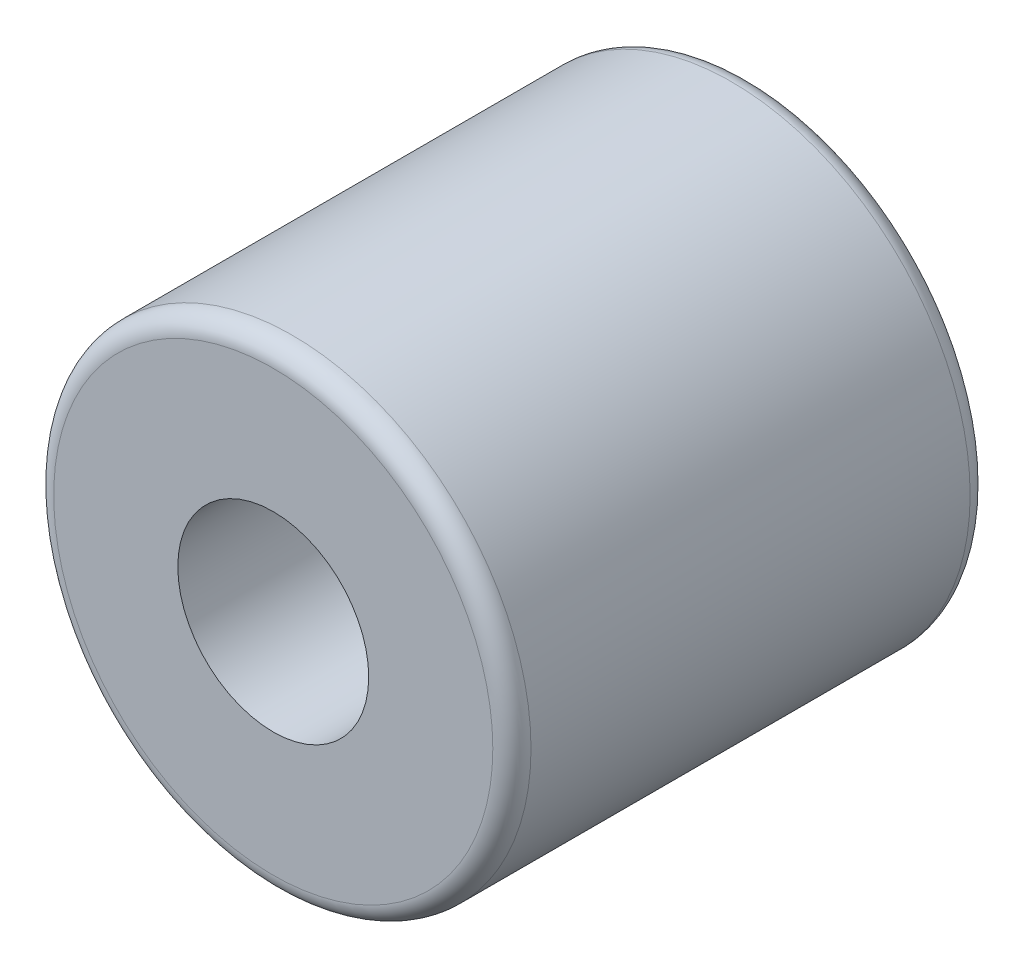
ISO-10303-21;
HEADER;
FILE_DESCRIPTION(('STEP AP214'),'2;1');
FILE_NAME('part.step','',(''),(''),'','','');
FILE_SCHEMA(('AUTOMOTIVE_DESIGN { 1 0 10303 214 1 1 1 1 }'));
ENDSEC;
DATA;
#1=APPLICATION_CONTEXT('core data for automotive mechanical design processes');
#2=APPLICATION_PROTOCOL_DEFINITION('international standard','automotive_design',2000,#1);
#3=PRODUCT_CONTEXT('',#1,'mechanical');
#4=PRODUCT('Part','Part','',(#3));
#5=PRODUCT_RELATED_PRODUCT_CATEGORY('part','',(#4));
#6=PRODUCT_DEFINITION_FORMATION('','',#4);
#7=PRODUCT_DEFINITION_CONTEXT('part definition',#1,'design');
#8=PRODUCT_DEFINITION('design','',#6,#7);
#9=PRODUCT_DEFINITION_SHAPE('','',#8);
#10=(LENGTH_UNIT() NAMED_UNIT(*) SI_UNIT(.MILLI.,.METRE.));
#11=(NAMED_UNIT(*) PLANE_ANGLE_UNIT() SI_UNIT($,.RADIAN.));
#12=(NAMED_UNIT(*) SI_UNIT($,.STERADIAN.) SOLID_ANGLE_UNIT());
#13=UNCERTAINTY_MEASURE_WITH_UNIT(LENGTH_MEASURE(1.E-05),#10,'distance_accuracy_value','');
#14=(GEOMETRIC_REPRESENTATION_CONTEXT(3) GLOBAL_UNCERTAINTY_ASSIGNED_CONTEXT((#13)) GLOBAL_UNIT_ASSIGNED_CONTEXT((#10,
#11,#12)) REPRESENTATION_CONTEXT('',''));
#15=CARTESIAN_POINT('',(0.,0.,0.));
#16=DIRECTION('',(0.,0.,1.));
#17=DIRECTION('',(1.,0.,0.));
#18=AXIS2_PLACEMENT_3D('',#15,#16,#17);
#19=CARTESIAN_POINT('',(0.,0.,63.5));
#20=DIRECTION('',(0.,0.,1.));
#21=DIRECTION('',(1.,0.,0.));
#22=AXIS2_PLACEMENT_3D('',#19,#20,#21);
#23=PLANE('',#22);
#24=CARTESIAN_POINT('',(0.,0.,63.5));
#25=DIRECTION('',(0.,0.,1.));
#26=DIRECTION('',(1.,0.,0.));
#27=AXIS2_PLACEMENT_3D('',#24,#25,#26);
#28=CIRCLE('',#27,29.21);
#29=CARTESIAN_POINT('',(29.21,0.,63.5));
#30=VERTEX_POINT('',#29);
#31=EDGE_CURVE('E10',#30,#30,#28,.T.);
#32=ORIENTED_EDGE('',*,*,#31,.T.);
#33=EDGE_LOOP('',(#32));
#34=FACE_BOUND('',#33,.T.);
#35=CARTESIAN_POINT('',(0.,0.,63.5));
#36=DIRECTION('',(0.,0.,1.));
#37=DIRECTION('',(1.,0.,0.));
#38=AXIS2_PLACEMENT_3D('',#35,#36,#37);
#39=CIRCLE('',#38,12.7);
#40=CARTESIAN_POINT('',(12.7,0.,63.5));
#41=VERTEX_POINT('',#40);
#42=EDGE_CURVE('E64',#41,#41,#39,.T.);
#43=ORIENTED_EDGE('',*,*,#42,.F.);
#44=EDGE_LOOP('',(#43));
#45=FACE_BOUND('',#44,.T.);
#46=ADVANCED_FACE('F40',(#34,#45),#23,.T.);
#47=CARTESIAN_POINT('',(0.,0.,0.));
#48=DIRECTION('',(0.,0.,1.));
#49=DIRECTION('',(1.,0.,0.));
#50=AXIS2_PLACEMENT_3D('',#47,#48,#49);
#51=PLANE('',#50);
#52=CARTESIAN_POINT('',(0.,0.,0.));
#53=DIRECTION('',(0.,0.,1.));
#54=DIRECTION('',(1.,0.,0.));
#55=AXIS2_PLACEMENT_3D('',#52,#53,#54);
#56=CIRCLE('',#55,29.21);
#57=CARTESIAN_POINT('',(29.21,0.,0.));
#58=VERTEX_POINT('',#57);
#59=EDGE_CURVE('E48',#58,#58,#56,.F.);
#60=ORIENTED_EDGE('',*,*,#59,.T.);
#61=EDGE_LOOP('',(#60));
#62=FACE_BOUND('',#61,.T.);
#63=CARTESIAN_POINT('',(0.,0.,0.));
#64=DIRECTION('',(0.,0.,1.));
#65=DIRECTION('',(1.,0.,0.));
#66=AXIS2_PLACEMENT_3D('',#63,#64,#65);
#67=CIRCLE('',#66,12.7);
#68=CARTESIAN_POINT('',(12.7,0.,0.));
#69=VERTEX_POINT('',#68);
#70=EDGE_CURVE('E65',#69,#69,#67,.T.);
#71=ORIENTED_EDGE('',*,*,#70,.T.);
#72=EDGE_LOOP('',(#71));
#73=FACE_BOUND('',#72,.T.);
#74=ADVANCED_FACE('F77',(#62,#73),#51,.F.);
#75=CARTESIAN_POINT('',(0.,0.,63.5));
#76=DIRECTION('',(0.,0.,-1.));
#77=DIRECTION('',(-1.,0.,0.));
#78=AXIS2_PLACEMENT_3D('',#75,#76,#77);
#79=CYLINDRICAL_SURFACE('',#78,31.75);
#80=CARTESIAN_POINT('',(0.,0.,2.54));
#81=DIRECTION('',(0.,0.,1.));
#82=DIRECTION('',(1.,0.,0.));
#83=AXIS2_PLACEMENT_3D('',#80,#81,#82);
#84=CIRCLE('',#83,31.75);
#85=CARTESIAN_POINT('',(31.75,0.,2.54));
#86=VERTEX_POINT('',#85);
#87=EDGE_CURVE('E53',#86,#86,#84,.T.);
#88=ORIENTED_EDGE('',*,*,#87,.T.);
#89=EDGE_LOOP('',(#88));
#90=FACE_BOUND('',#89,.T.);
#91=CARTESIAN_POINT('',(0.,0.,60.96));
#92=DIRECTION('',(0.,0.,1.));
#93=DIRECTION('',(1.,0.,0.));
#94=AXIS2_PLACEMENT_3D('',#91,#92,#93);
#95=CIRCLE('',#94,31.75);
#96=CARTESIAN_POINT('',(31.75,0.,60.96));
#97=VERTEX_POINT('',#96);
#98=EDGE_CURVE('E58',#97,#97,#95,.F.);
#99=ORIENTED_EDGE('',*,*,#98,.T.);
#100=EDGE_LOOP('',(#99));
#101=FACE_BOUND('',#100,.T.);
#102=ADVANCED_FACE('F83',(#90,#101),#79,.T.);
#103=CARTESIAN_POINT('',(0.,0.,63.5));
#104=DIRECTION('',(0.,0.,-1.));
#105=DIRECTION('',(-1.,0.,0.));
#106=AXIS2_PLACEMENT_3D('',#103,#104,#105);
#107=CYLINDRICAL_SURFACE('',#106,12.7);
#108=ORIENTED_EDGE('',*,*,#42,.T.);
#109=EDGE_LOOP('',(#108));
#110=FACE_BOUND('',#109,.T.);
#111=ORIENTED_EDGE('',*,*,#70,.F.);
#112=EDGE_LOOP('',(#111));
#113=FACE_BOUND('',#112,.T.);
#114=ADVANCED_FACE('F73',(#110,#113),#107,.F.);
#115=CARTESIAN_POINT('',(0.,0.,2.54));
#116=DIRECTION('',(0.,0.,1.));
#117=DIRECTION('',(1.,0.,0.));
#118=AXIS2_PLACEMENT_3D('',#115,#116,#117);
#119=TOROIDAL_SURFACE('',#118,29.21,2.54);
#120=ORIENTED_EDGE('',*,*,#59,.F.);
#121=EDGE_LOOP('',(#120));
#122=FACE_BOUND('',#121,.T.);
#123=ORIENTED_EDGE('',*,*,#87,.F.);
#124=EDGE_LOOP('',(#123));
#125=FACE_BOUND('',#124,.T.);
#126=ADVANCED_FACE('F89',(#122,#125),#119,.T.);
#127=CARTESIAN_POINT('',(0.,0.,60.96));
#128=DIRECTION('',(0.,0.,1.));
#129=DIRECTION('',(1.,0.,0.));
#130=AXIS2_PLACEMENT_3D('',#127,#128,#129);
#131=TOROIDAL_SURFACE('',#130,29.21,2.54);
#132=ORIENTED_EDGE('',*,*,#98,.F.);
#133=EDGE_LOOP('',(#132));
#134=FACE_BOUND('',#133,.T.);
#135=ORIENTED_EDGE('',*,*,#31,.F.);
#136=EDGE_LOOP('',(#135));
#137=FACE_BOUND('',#136,.T.);
#138=ADVANCED_FACE('F42',(#134,#137),#131,.T.);
#139=CLOSED_SHELL('',(#46,#74,#102,#114,#126,#138));
#140=MANIFOLD_SOLID_BREP('B2',#139);
#141=ADVANCED_BREP_SHAPE_REPRESENTATION('',(#18,#140),#14);
#142=SHAPE_DEFINITION_REPRESENTATION(#9,#141);
ENDSEC;
END-ISO-10303-21;
